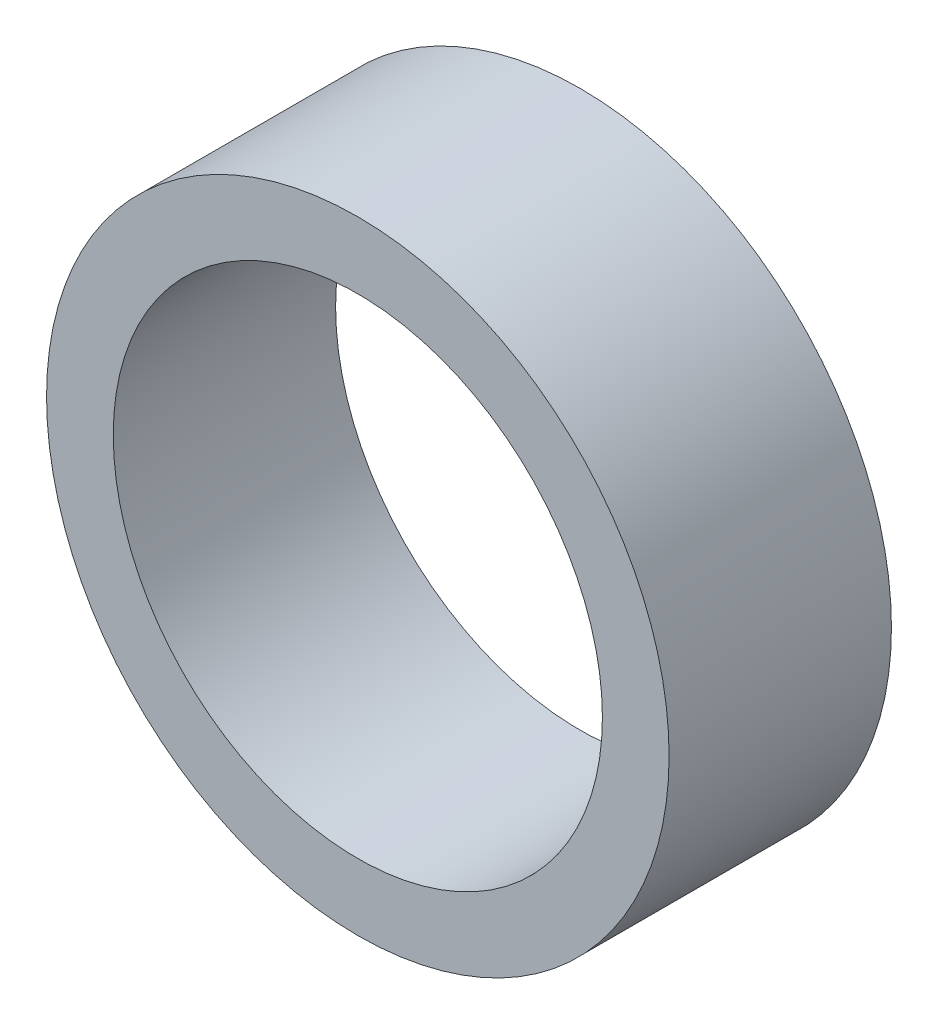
ISO-10303-21;
HEADER;
FILE_DESCRIPTION(('STEP AP214'),'2;1');
FILE_NAME('part.step','',(''),(''),'','','');
FILE_SCHEMA(('AUTOMOTIVE_DESIGN { 1 0 10303 214 1 1 1 1 }'));
ENDSEC;
DATA;
#1=APPLICATION_CONTEXT('core data for automotive mechanical design processes');
#2=APPLICATION_PROTOCOL_DEFINITION('international standard','automotive_design',2000,#1);
#3=PRODUCT_CONTEXT('',#1,'mechanical');
#4=PRODUCT('Part','Part','',(#3));
#5=PRODUCT_RELATED_PRODUCT_CATEGORY('part','',(#4));
#6=PRODUCT_DEFINITION_FORMATION('','',#4);
#7=PRODUCT_DEFINITION_CONTEXT('part definition',#1,'design');
#8=PRODUCT_DEFINITION('design','',#6,#7);
#9=PRODUCT_DEFINITION_SHAPE('','',#8);
#10=(LENGTH_UNIT() NAMED_UNIT(*) SI_UNIT(.MILLI.,.METRE.));
#11=(NAMED_UNIT(*) PLANE_ANGLE_UNIT() SI_UNIT($,.RADIAN.));
#12=(NAMED_UNIT(*) SI_UNIT($,.STERADIAN.) SOLID_ANGLE_UNIT());
#13=UNCERTAINTY_MEASURE_WITH_UNIT(LENGTH_MEASURE(1.E-05),#10,'distance_accuracy_value','');
#14=(GEOMETRIC_REPRESENTATION_CONTEXT(3) GLOBAL_UNCERTAINTY_ASSIGNED_CONTEXT((#13)) GLOBAL_UNIT_ASSIGNED_CONTEXT((#10,
#11,#12)) REPRESENTATION_CONTEXT('',''));
#15=CARTESIAN_POINT('',(0.,0.,0.));
#16=DIRECTION('',(0.,0.,1.));
#17=DIRECTION('',(1.,0.,0.));
#18=AXIS2_PLACEMENT_3D('',#15,#16,#17);
#19=CARTESIAN_POINT('',(0.,0.,5.));
#20=DIRECTION('',(0.,0.,-1.));
#21=DIRECTION('',(-1.,0.,0.));
#22=AXIS2_PLACEMENT_3D('',#19,#20,#21);
#23=CYLINDRICAL_SURFACE('',#22,7.);
#24=CARTESIAN_POINT('',(0.,0.,5.));
#25=DIRECTION('',(0.,0.,1.));
#26=DIRECTION('',(1.,0.,0.));
#27=AXIS2_PLACEMENT_3D('',#24,#25,#26);
#28=CIRCLE('',#27,7.);
#29=CARTESIAN_POINT('',(7.,0.,5.));
#30=VERTEX_POINT('',#29);
#31=EDGE_CURVE('E10',#30,#30,#28,.T.);
#32=ORIENTED_EDGE('',*,*,#31,.F.);
#33=EDGE_LOOP('',(#32));
#34=FACE_BOUND('',#33,.T.);
#35=CARTESIAN_POINT('',(0.,0.,0.));
#36=DIRECTION('',(0.,0.,1.));
#37=DIRECTION('',(1.,0.,0.));
#38=AXIS2_PLACEMENT_3D('',#35,#36,#37);
#39=CIRCLE('',#38,7.);
#40=CARTESIAN_POINT('',(7.,0.,0.));
#41=VERTEX_POINT('',#40);
#42=EDGE_CURVE('E38',#41,#41,#39,.T.);
#43=ORIENTED_EDGE('',*,*,#42,.T.);
#44=EDGE_LOOP('',(#43));
#45=FACE_BOUND('',#44,.T.);
#46=ADVANCED_FACE('F31',(#34,#45),#23,.T.);
#47=CARTESIAN_POINT('',(0.,0.,5.));
#48=DIRECTION('',(0.,0.,1.));
#49=DIRECTION('',(1.,0.,0.));
#50=AXIS2_PLACEMENT_3D('',#47,#48,#49);
#51=PLANE('',#50);
#52=CARTESIAN_POINT('',(0.,0.,5.));
#53=DIRECTION('',(0.,0.,1.));
#54=DIRECTION('',(1.,0.,0.));
#55=AXIS2_PLACEMENT_3D('',#52,#53,#54);
#56=CIRCLE('',#55,5.5);
#57=CARTESIAN_POINT('',(5.5,0.,5.));
#58=VERTEX_POINT('',#57);
#59=EDGE_CURVE('E44',#58,#58,#56,.T.);
#60=ORIENTED_EDGE('',*,*,#59,.F.);
#61=EDGE_LOOP('',(#60));
#62=FACE_BOUND('',#61,.T.);
#63=ORIENTED_EDGE('',*,*,#31,.T.);
#64=EDGE_LOOP('',(#63));
#65=FACE_BOUND('',#64,.T.);
#66=ADVANCED_FACE('F60',(#62,#65),#51,.T.);
#67=CARTESIAN_POINT('',(0.,0.,0.));
#68=DIRECTION('',(0.,0.,1.));
#69=DIRECTION('',(1.,0.,0.));
#70=AXIS2_PLACEMENT_3D('',#67,#68,#69);
#71=PLANE('',#70);
#72=CARTESIAN_POINT('',(0.,0.,0.));
#73=DIRECTION('',(0.,0.,1.));
#74=DIRECTION('',(1.,0.,0.));
#75=AXIS2_PLACEMENT_3D('',#72,#73,#74);
#76=CIRCLE('',#75,5.5);
#77=CARTESIAN_POINT('',(5.5,0.,0.));
#78=VERTEX_POINT('',#77);
#79=EDGE_CURVE('E34',#78,#78,#76,.T.);
#80=ORIENTED_EDGE('',*,*,#79,.T.);
#81=EDGE_LOOP('',(#80));
#82=FACE_BOUND('',#81,.T.);
#83=ORIENTED_EDGE('',*,*,#42,.F.);
#84=EDGE_LOOP('',(#83));
#85=FACE_BOUND('',#84,.T.);
#86=ADVANCED_FACE('F51',(#82,#85),#71,.F.);
#87=CARTESIAN_POINT('',(0.,0.,-30.));
#88=DIRECTION('',(0.,0.,1.));
#89=DIRECTION('',(1.,0.,0.));
#90=AXIS2_PLACEMENT_3D('',#87,#88,#89);
#91=CYLINDRICAL_SURFACE('',#90,5.5);
#92=ORIENTED_EDGE('',*,*,#59,.T.);
#93=EDGE_LOOP('',(#92));
#94=FACE_BOUND('',#93,.T.);
#95=ORIENTED_EDGE('',*,*,#79,.F.);
#96=EDGE_LOOP('',(#95));
#97=FACE_BOUND('',#96,.T.);
#98=ADVANCED_FACE('F54',(#94,#97),#91,.F.);
#99=CLOSED_SHELL('',(#46,#66,#86,#98));
#100=MANIFOLD_SOLID_BREP('B2',#99);
#101=ADVANCED_BREP_SHAPE_REPRESENTATION('',(#18,#100),#14);
#102=SHAPE_DEFINITION_REPRESENTATION(#9,#101);
ENDSEC;
END-ISO-10303-21;
